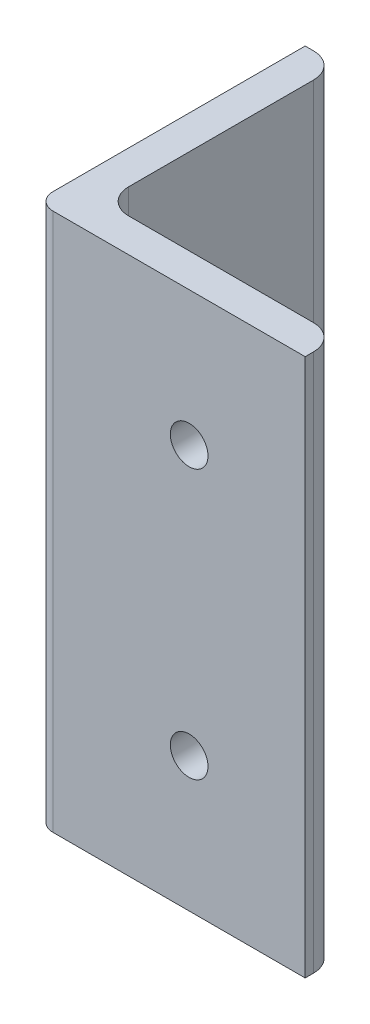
ISO-10303-21;
HEADER;
FILE_DESCRIPTION(('STEP AP214'),'2;1');
FILE_NAME('part.step','',(''),(''),'','','');
FILE_SCHEMA(('AUTOMOTIVE_DESIGN { 1 0 10303 214 1 1 1 1 }'));
ENDSEC;
DATA;
#1=APPLICATION_CONTEXT('core data for automotive mechanical design processes');
#2=APPLICATION_PROTOCOL_DEFINITION('international standard','automotive_design',2000,#1);
#3=PRODUCT_CONTEXT('',#1,'mechanical');
#4=PRODUCT('Part','Part','',(#3));
#5=PRODUCT_RELATED_PRODUCT_CATEGORY('part','',(#4));
#6=PRODUCT_DEFINITION_FORMATION('','',#4);
#7=PRODUCT_DEFINITION_CONTEXT('part definition',#1,'design');
#8=PRODUCT_DEFINITION('design','',#6,#7);
#9=PRODUCT_DEFINITION_SHAPE('','',#8);
#10=(LENGTH_UNIT() NAMED_UNIT(*) SI_UNIT(.MILLI.,.METRE.));
#11=(NAMED_UNIT(*) PLANE_ANGLE_UNIT() SI_UNIT($,.RADIAN.));
#12=(NAMED_UNIT(*) SI_UNIT($,.STERADIAN.) SOLID_ANGLE_UNIT());
#13=UNCERTAINTY_MEASURE_WITH_UNIT(LENGTH_MEASURE(1.E-05),#10,'distance_accuracy_value','');
#14=(GEOMETRIC_REPRESENTATION_CONTEXT(3) GLOBAL_UNCERTAINTY_ASSIGNED_CONTEXT((#13)) GLOBAL_UNIT_ASSIGNED_CONTEXT((#10,
#11,#12)) REPRESENTATION_CONTEXT('',''));
#15=CARTESIAN_POINT('',(0.,0.,0.));
#16=DIRECTION('',(0.,0.,1.));
#17=DIRECTION('',(1.,0.,0.));
#18=AXIS2_PLACEMENT_3D('',#15,#16,#17);
#19=CARTESIAN_POINT('',(25.4,50.8,0.));
#20=DIRECTION('',(0.,0.,-1.));
#21=DIRECTION('',(-1.,0.,0.));
#22=AXIS2_PLACEMENT_3D('',#19,#20,#21);
#23=PLANE('',#22);
#24=CARTESIAN_POINT('',(14.44625,38.1,0.));
#25=DIRECTION('',(0.,0.,-1.));
#26=DIRECTION('',(-1.,0.,0.));
#27=AXIS2_PLACEMENT_3D('',#24,#25,#26);
#28=CIRCLE('',#27,1.778);
#29=CARTESIAN_POINT('',(12.66825,38.1,0.));
#30=VERTEX_POINT('',#29);
#31=EDGE_CURVE('E240',#30,#30,#28,.T.);
#32=ORIENTED_EDGE('',*,*,#31,.T.);
#33=EDGE_LOOP('',(#32));
#34=FACE_BOUND('',#33,.T.);
#35=CARTESIAN_POINT('',(14.44625,12.7,0.));
#36=DIRECTION('',(0.,0.,-1.));
#37=DIRECTION('',(-1.,0.,0.));
#38=AXIS2_PLACEMENT_3D('',#35,#36,#37);
#39=CIRCLE('',#38,1.778);
#40=CARTESIAN_POINT('',(12.66825,12.7,0.));
#41=VERTEX_POINT('',#40);
#42=EDGE_CURVE('E245',#41,#41,#39,.T.);
#43=ORIENTED_EDGE('',*,*,#42,.T.);
#44=EDGE_LOOP('',(#43));
#45=FACE_BOUND('',#44,.T.);
#46=DIRECTION('',(1.,0.,0.));
#47=VECTOR('',#46,1.);
#48=CARTESIAN_POINT('',(25.4,50.8,0.));
#49=LINE('',#48,#47);
#50=CARTESIAN_POINT('',(1.5875,50.8,0.));
#51=VERTEX_POINT('',#50);
#52=CARTESIAN_POINT('',(25.4,50.8,0.));
#53=VERTEX_POINT('',#52);
#54=EDGE_CURVE('E113',#51,#53,#49,.T.);
#55=ORIENTED_EDGE('',*,*,#54,.F.);
#56=DIRECTION('',(0.,-1.,0.));
#57=VECTOR('',#56,1.);
#58=CARTESIAN_POINT('',(1.5875,50.8,0.));
#59=LINE('',#58,#57);
#60=CARTESIAN_POINT('',(1.5875,0.,0.));
#61=VERTEX_POINT('',#60);
#62=EDGE_CURVE('E169',#51,#61,#59,.T.);
#63=ORIENTED_EDGE('',*,*,#62,.T.);
#64=DIRECTION('',(1.,0.,0.));
#65=VECTOR('',#64,1.);
#66=CARTESIAN_POINT('',(25.4,0.,0.));
#67=LINE('',#66,#65);
#68=CARTESIAN_POINT('',(25.4,0.,0.));
#69=VERTEX_POINT('',#68);
#70=EDGE_CURVE('E134',#61,#69,#67,.T.);
#71=ORIENTED_EDGE('',*,*,#70,.T.);
#72=DIRECTION('',(0.,-1.,0.));
#73=VECTOR('',#72,1.);
#74=CARTESIAN_POINT('',(25.4,50.8,0.));
#75=LINE('',#74,#73);
#76=EDGE_CURVE('E129',#53,#69,#75,.T.);
#77=ORIENTED_EDGE('',*,*,#76,.F.);
#78=EDGE_LOOP('',(#55,#63,#71,#77));
#79=FACE_BOUND('',#78,.T.);
#80=ADVANCED_FACE('F36',(#34,#45,#79),#23,.F.);
#81=CARTESIAN_POINT('',(25.4,50.8,-3.175));
#82=DIRECTION('',(-1.,0.,0.));
#83=DIRECTION('',(0.,0.,1.));
#84=AXIS2_PLACEMENT_3D('',#81,#82,#83);
#85=PLANE('',#84);
#86=DIRECTION('',(0.,0.,-1.));
#87=VECTOR('',#86,1.);
#88=CARTESIAN_POINT('',(25.4,0.,-3.175));
#89=LINE('',#88,#87);
#90=CARTESIAN_POINT('',(25.4,0.,-0.79375));
#91=VERTEX_POINT('',#90);
#92=EDGE_CURVE('E173',#69,#91,#89,.T.);
#93=ORIENTED_EDGE('',*,*,#92,.T.);
#94=DIRECTION('',(0.,-1.,0.));
#95=VECTOR('',#94,1.);
#96=CARTESIAN_POINT('',(25.4,50.8,-0.79375));
#97=LINE('',#96,#95);
#98=CARTESIAN_POINT('',(25.4,50.8,-0.79375));
#99=VERTEX_POINT('',#98);
#100=EDGE_CURVE('E131',#91,#99,#97,.F.);
#101=ORIENTED_EDGE('',*,*,#100,.T.);
#102=DIRECTION('',(0.,0.,-1.));
#103=VECTOR('',#102,1.);
#104=CARTESIAN_POINT('',(25.4,50.8,-3.175));
#105=LINE('',#104,#103);
#106=EDGE_CURVE('E116',#53,#99,#105,.T.);
#107=ORIENTED_EDGE('',*,*,#106,.F.);
#108=ORIENTED_EDGE('',*,*,#76,.T.);
#109=EDGE_LOOP('',(#93,#101,#107,#108));
#110=FACE_BOUND('',#109,.T.);
#111=ADVANCED_FACE('F128',(#110),#85,.F.);
#112=CARTESIAN_POINT('',(3.175,50.8,-3.175));
#113=DIRECTION('',(0.,0.,1.));
#114=DIRECTION('',(1.,0.,0.));
#115=AXIS2_PLACEMENT_3D('',#112,#113,#114);
#116=PLANE('',#115);
#117=CARTESIAN_POINT('',(14.44625,38.1,-3.175));
#118=DIRECTION('',(0.,0.,-1.));
#119=DIRECTION('',(-1.,0.,0.));
#120=AXIS2_PLACEMENT_3D('',#117,#118,#119);
#121=CIRCLE('',#120,1.778);
#122=CARTESIAN_POINT('',(12.66825,38.1,-3.175));
#123=VERTEX_POINT('',#122);
#124=EDGE_CURVE('E248',#123,#123,#121,.T.);
#125=ORIENTED_EDGE('',*,*,#124,.F.);
#126=EDGE_LOOP('',(#125));
#127=FACE_BOUND('',#126,.T.);
#128=CARTESIAN_POINT('',(14.44625,12.7,-3.175));
#129=DIRECTION('',(0.,0.,-1.));
#130=DIRECTION('',(-1.,0.,0.));
#131=AXIS2_PLACEMENT_3D('',#128,#129,#130);
#132=CIRCLE('',#131,1.778);
#133=CARTESIAN_POINT('',(12.66825,12.7,-3.175));
#134=VERTEX_POINT('',#133);
#135=EDGE_CURVE('E242',#134,#134,#132,.T.);
#136=ORIENTED_EDGE('',*,*,#135,.F.);
#137=EDGE_LOOP('',(#136));
#138=FACE_BOUND('',#137,.T.);
#139=DIRECTION('',(-1.,0.,0.));
#140=VECTOR('',#139,1.);
#141=CARTESIAN_POINT('',(3.175,0.,-3.175));
#142=LINE('',#141,#140);
#143=CARTESIAN_POINT('',(23.01875,0.,-3.175));
#144=VERTEX_POINT('',#143);
#145=CARTESIAN_POINT('',(5.55625,0.,-3.175));
#146=VERTEX_POINT('',#145);
#147=EDGE_CURVE('E176',#144,#146,#142,.T.);
#148=ORIENTED_EDGE('',*,*,#147,.T.);
#149=DIRECTION('',(0.,-1.,0.));
#150=VECTOR('',#149,1.);
#151=CARTESIAN_POINT('',(5.55625,50.8,-3.175));
#152=LINE('',#151,#150);
#153=CARTESIAN_POINT('',(5.55625,50.8,-3.175));
#154=VERTEX_POINT('',#153);
#155=EDGE_CURVE('E151',#146,#154,#152,.F.);
#156=ORIENTED_EDGE('',*,*,#155,.T.);
#157=DIRECTION('',(-1.,0.,0.));
#158=VECTOR('',#157,1.);
#159=CARTESIAN_POINT('',(3.175,50.8,-3.175));
#160=LINE('',#159,#158);
#161=CARTESIAN_POINT('',(23.01875,50.8,-3.175));
#162=VERTEX_POINT('',#161);
#163=EDGE_CURVE('E132',#162,#154,#160,.T.);
#164=ORIENTED_EDGE('',*,*,#163,.F.);
#165=DIRECTION('',(0.,-1.,0.));
#166=VECTOR('',#165,1.);
#167=CARTESIAN_POINT('',(23.01875,50.8,-3.175));
#168=LINE('',#167,#166);
#169=EDGE_CURVE('E148',#162,#144,#168,.T.);
#170=ORIENTED_EDGE('',*,*,#169,.T.);
#171=EDGE_LOOP('',(#148,#156,#164,#170));
#172=FACE_BOUND('',#171,.T.);
#173=ADVANCED_FACE('F211',(#127,#138,#172),#116,.F.);
#174=CARTESIAN_POINT('',(3.175,50.8,-25.4));
#175=DIRECTION('',(-1.,0.,0.));
#176=DIRECTION('',(0.,0.,1.));
#177=AXIS2_PLACEMENT_3D('',#174,#175,#176);
#178=PLANE('',#177);
#179=CARTESIAN_POINT('',(3.175,25.4,-13.97));
#180=DIRECTION('',(1.,0.,0.));
#181=DIRECTION('',(0.,0.,-1.));
#182=AXIS2_PLACEMENT_3D('',#179,#180,#181);
#183=CIRCLE('',#182,6.35);
#184=CARTESIAN_POINT('',(3.175,25.4,-20.32));
#185=VERTEX_POINT('',#184);
#186=EDGE_CURVE('E179',#185,#185,#183,.T.);
#187=ORIENTED_EDGE('',*,*,#186,.F.);
#188=EDGE_LOOP('',(#187));
#189=FACE_BOUND('',#188,.T.);
#190=DIRECTION('',(0.,0.,-1.));
#191=VECTOR('',#190,1.);
#192=CARTESIAN_POINT('',(3.175,50.8,-25.4));
#193=LINE('',#192,#191);
#194=CARTESIAN_POINT('',(3.175,50.8,-5.55625));
#195=VERTEX_POINT('',#194);
#196=CARTESIAN_POINT('',(3.175,50.8,-23.01875));
#197=VERTEX_POINT('',#196);
#198=EDGE_CURVE('E232',#195,#197,#193,.T.);
#199=ORIENTED_EDGE('',*,*,#198,.F.);
#200=DIRECTION('',(0.,-1.,0.));
#201=VECTOR('',#200,1.);
#202=CARTESIAN_POINT('',(3.175,0.,-5.55625));
#203=LINE('',#202,#201);
#204=CARTESIAN_POINT('',(3.175,0.,-5.55625));
#205=VERTEX_POINT('',#204);
#206=EDGE_CURVE('E139',#195,#205,#203,.T.);
#207=ORIENTED_EDGE('',*,*,#206,.T.);
#208=DIRECTION('',(0.,0.,-1.));
#209=VECTOR('',#208,1.);
#210=CARTESIAN_POINT('',(3.175,0.,-25.4));
#211=LINE('',#210,#209);
#212=CARTESIAN_POINT('',(3.175,0.,-23.01875));
#213=VERTEX_POINT('',#212);
#214=EDGE_CURVE('E186',#205,#213,#211,.T.);
#215=ORIENTED_EDGE('',*,*,#214,.T.);
#216=DIRECTION('',(0.,-1.,0.));
#217=VECTOR('',#216,1.);
#218=CARTESIAN_POINT('',(3.175,50.8,-23.01875));
#219=LINE('',#218,#217);
#220=EDGE_CURVE('E136',#213,#197,#219,.F.);
#221=ORIENTED_EDGE('',*,*,#220,.T.);
#222=EDGE_LOOP('',(#199,#207,#215,#221));
#223=FACE_BOUND('',#222,.T.);
#224=ADVANCED_FACE('F261',(#189,#223),#178,.F.);
#225=CARTESIAN_POINT('',(0.,50.8,-25.4));
#226=DIRECTION('',(0.,0.,1.));
#227=DIRECTION('',(1.,0.,0.));
#228=AXIS2_PLACEMENT_3D('',#225,#226,#227);
#229=PLANE('',#228);
#230=DIRECTION('',(-1.,0.,0.));
#231=VECTOR('',#230,1.);
#232=CARTESIAN_POINT('',(0.,50.8,-25.4));
#233=LINE('',#232,#231);
#234=CARTESIAN_POINT('',(0.79375,50.8,-25.4));
#235=VERTEX_POINT('',#234);
#236=CARTESIAN_POINT('',(0.,50.8,-25.4));
#237=VERTEX_POINT('',#236);
#238=EDGE_CURVE('E230',#235,#237,#233,.T.);
#239=ORIENTED_EDGE('',*,*,#238,.F.);
#240=DIRECTION('',(0.,-1.,0.));
#241=VECTOR('',#240,1.);
#242=CARTESIAN_POINT('',(0.79375,50.8,-25.4));
#243=LINE('',#242,#241);
#244=CARTESIAN_POINT('',(0.79375,0.,-25.4));
#245=VERTEX_POINT('',#244);
#246=EDGE_CURVE('E153',#235,#245,#243,.T.);
#247=ORIENTED_EDGE('',*,*,#246,.T.);
#248=DIRECTION('',(-1.,0.,0.));
#249=VECTOR('',#248,1.);
#250=CARTESIAN_POINT('',(0.,0.,-25.4));
#251=LINE('',#250,#249);
#252=CARTESIAN_POINT('',(0.,0.,-25.4));
#253=VERTEX_POINT('',#252);
#254=EDGE_CURVE('E189',#245,#253,#251,.T.);
#255=ORIENTED_EDGE('',*,*,#254,.T.);
#256=DIRECTION('',(0.,-1.,0.));
#257=VECTOR('',#256,1.);
#258=CARTESIAN_POINT('',(0.,50.8,-25.4));
#259=LINE('',#258,#257);
#260=EDGE_CURVE('E137',#237,#253,#259,.T.);
#261=ORIENTED_EDGE('',*,*,#260,.F.);
#262=EDGE_LOOP('',(#239,#247,#255,#261));
#263=FACE_BOUND('',#262,.T.);
#264=ADVANCED_FACE('F234',(#263),#229,.F.);
#265=CARTESIAN_POINT('',(0.,50.8,0.));
#266=DIRECTION('',(1.,0.,0.));
#267=DIRECTION('',(0.,0.,-1.));
#268=AXIS2_PLACEMENT_3D('',#265,#266,#267);
#269=PLANE('',#268);
#270=CARTESIAN_POINT('',(0.,25.4,-13.97));
#271=DIRECTION('',(1.,0.,0.));
#272=DIRECTION('',(0.,0.,-1.));
#273=AXIS2_PLACEMENT_3D('',#270,#271,#272);
#274=CIRCLE('',#273,6.35);
#275=CARTESIAN_POINT('',(0.,25.4,-20.32));
#276=VERTEX_POINT('',#275);
#277=EDGE_CURVE('E174',#276,#276,#274,.T.);
#278=ORIENTED_EDGE('',*,*,#277,.T.);
#279=EDGE_LOOP('',(#278));
#280=FACE_BOUND('',#279,.T.);
#281=DIRECTION('',(0.,0.,1.));
#282=VECTOR('',#281,1.);
#283=CARTESIAN_POINT('',(0.,0.,0.));
#284=LINE('',#283,#282);
#285=CARTESIAN_POINT('',(0.,0.,-1.5875));
#286=VERTEX_POINT('',#285);
#287=EDGE_CURVE('E123',#253,#286,#284,.T.);
#288=ORIENTED_EDGE('',*,*,#287,.T.);
#289=DIRECTION('',(0.,-1.,0.));
#290=VECTOR('',#289,1.);
#291=CARTESIAN_POINT('',(0.,50.8,-1.5875));
#292=LINE('',#291,#290);
#293=CARTESIAN_POINT('',(0.,50.8,-1.5875));
#294=VERTEX_POINT('',#293);
#295=EDGE_CURVE('E44',#286,#294,#292,.F.);
#296=ORIENTED_EDGE('',*,*,#295,.T.);
#297=DIRECTION('',(0.,0.,1.));
#298=VECTOR('',#297,1.);
#299=CARTESIAN_POINT('',(0.,50.8,0.));
#300=LINE('',#299,#298);
#301=EDGE_CURVE('E142',#237,#294,#300,.T.);
#302=ORIENTED_EDGE('',*,*,#301,.F.);
#303=ORIENTED_EDGE('',*,*,#260,.T.);
#304=EDGE_LOOP('',(#288,#296,#302,#303));
#305=FACE_BOUND('',#304,.T.);
#306=ADVANCED_FACE('F190',(#280,#305),#269,.F.);
#307=CARTESIAN_POINT('',(0.,50.8,0.));
#308=DIRECTION('',(0.,-1.,0.));
#309=DIRECTION('',(0.,0.,-1.));
#310=AXIS2_PLACEMENT_3D('',#307,#308,#309);
#311=PLANE('',#310);
#312=ORIENTED_EDGE('',*,*,#301,.T.);
#313=CARTESIAN_POINT('',(1.5875,50.8,-1.5875));
#314=DIRECTION('',(0.,-1.,0.));
#315=DIRECTION('',(0.,0.,-1.));
#316=AXIS2_PLACEMENT_3D('',#313,#314,#315);
#317=CIRCLE('',#316,1.5875);
#318=EDGE_CURVE('E11',#294,#51,#317,.F.);
#319=ORIENTED_EDGE('',*,*,#318,.T.);
#320=ORIENTED_EDGE('',*,*,#54,.T.);
#321=ORIENTED_EDGE('',*,*,#106,.T.);
#322=CARTESIAN_POINT('',(23.01875,50.8,-0.79375));
#323=DIRECTION('',(0.,-1.,0.));
#324=DIRECTION('',(0.,0.,-1.));
#325=AXIS2_PLACEMENT_3D('',#322,#323,#324);
#326=CIRCLE('',#325,2.38125);
#327=EDGE_CURVE('E160',#99,#162,#326,.F.);
#328=ORIENTED_EDGE('',*,*,#327,.T.);
#329=ORIENTED_EDGE('',*,*,#163,.T.);
#330=CARTESIAN_POINT('',(5.55625,50.8,-5.55625));
#331=DIRECTION('',(0.,-1.,0.));
#332=DIRECTION('',(0.,0.,-1.));
#333=AXIS2_PLACEMENT_3D('',#330,#331,#332);
#334=CIRCLE('',#333,2.38125);
#335=EDGE_CURVE('E167',#154,#195,#334,.T.);
#336=ORIENTED_EDGE('',*,*,#335,.T.);
#337=ORIENTED_EDGE('',*,*,#198,.T.);
#338=CARTESIAN_POINT('',(0.79375,50.8,-23.01875));
#339=DIRECTION('',(0.,-1.,0.));
#340=DIRECTION('',(0.,0.,-1.));
#341=AXIS2_PLACEMENT_3D('',#338,#339,#340);
#342=CIRCLE('',#341,2.38125);
#343=EDGE_CURVE('E162',#197,#235,#342,.F.);
#344=ORIENTED_EDGE('',*,*,#343,.T.);
#345=ORIENTED_EDGE('',*,*,#238,.T.);
#346=EDGE_LOOP('',(#312,#319,#320,#321,#328,#329,#336,#337,#344,#345));
#347=FACE_BOUND('',#346,.T.);
#348=ADVANCED_FACE('F115',(#347),#311,.F.);
#349=CARTESIAN_POINT('',(0.,0.,0.));
#350=DIRECTION('',(0.,-1.,0.));
#351=DIRECTION('',(0.,0.,-1.));
#352=AXIS2_PLACEMENT_3D('',#349,#350,#351);
#353=PLANE('',#352);
#354=ORIENTED_EDGE('',*,*,#70,.F.);
#355=CARTESIAN_POINT('',(1.5875,0.,-1.5875));
#356=DIRECTION('',(0.,-1.,0.));
#357=DIRECTION('',(0.,0.,-1.));
#358=AXIS2_PLACEMENT_3D('',#355,#356,#357);
#359=CIRCLE('',#358,1.5875);
#360=EDGE_CURVE('E58',#61,#286,#359,.T.);
#361=ORIENTED_EDGE('',*,*,#360,.T.);
#362=ORIENTED_EDGE('',*,*,#287,.F.);
#363=ORIENTED_EDGE('',*,*,#254,.F.);
#364=CARTESIAN_POINT('',(0.79375,0.,-23.01875));
#365=DIRECTION('',(0.,-1.,0.));
#366=DIRECTION('',(0.,0.,-1.));
#367=AXIS2_PLACEMENT_3D('',#364,#365,#366);
#368=CIRCLE('',#367,2.38125);
#369=EDGE_CURVE('E158',#245,#213,#368,.T.);
#370=ORIENTED_EDGE('',*,*,#369,.T.);
#371=ORIENTED_EDGE('',*,*,#214,.F.);
#372=CARTESIAN_POINT('',(5.55625,0.,-5.55625));
#373=DIRECTION('',(0.,-1.,0.));
#374=DIRECTION('',(0.,0.,-1.));
#375=AXIS2_PLACEMENT_3D('',#372,#373,#374);
#376=CIRCLE('',#375,2.38125);
#377=EDGE_CURVE('E165',#205,#146,#376,.F.);
#378=ORIENTED_EDGE('',*,*,#377,.T.);
#379=ORIENTED_EDGE('',*,*,#147,.F.);
#380=CARTESIAN_POINT('',(23.01875,0.,-0.79375));
#381=DIRECTION('',(0.,-1.,0.));
#382=DIRECTION('',(0.,0.,-1.));
#383=AXIS2_PLACEMENT_3D('',#380,#381,#382);
#384=CIRCLE('',#383,2.38125);
#385=EDGE_CURVE('E156',#144,#91,#384,.T.);
#386=ORIENTED_EDGE('',*,*,#385,.T.);
#387=ORIENTED_EDGE('',*,*,#92,.F.);
#388=EDGE_LOOP('',(#354,#361,#362,#363,#370,#371,#378,#379,#386,#387));
#389=FACE_BOUND('',#388,.T.);
#390=ADVANCED_FACE('F172',(#389),#353,.T.);
#391=CARTESIAN_POINT('',(5.55625,50.8,-5.55625));
#392=DIRECTION('',(0.,1.,0.));
#393=DIRECTION('',(0.,0.,1.));
#394=AXIS2_PLACEMENT_3D('',#391,#392,#393);
#395=CYLINDRICAL_SURFACE('',#394,2.38125);
#396=ORIENTED_EDGE('',*,*,#335,.F.);
#397=ORIENTED_EDGE('',*,*,#155,.F.);
#398=ORIENTED_EDGE('',*,*,#377,.F.);
#399=ORIENTED_EDGE('',*,*,#206,.F.);
#400=EDGE_LOOP('',(#396,#397,#398,#399));
#401=FACE_BOUND('',#400,.T.);
#402=ADVANCED_FACE('F217',(#401),#395,.F.);
#403=CARTESIAN_POINT('',(0.79375,50.8,-23.01875));
#404=DIRECTION('',(0.,-1.,0.));
#405=DIRECTION('',(0.,0.,-1.));
#406=AXIS2_PLACEMENT_3D('',#403,#404,#405);
#407=CYLINDRICAL_SURFACE('',#406,2.38125);
#408=ORIENTED_EDGE('',*,*,#343,.F.);
#409=ORIENTED_EDGE('',*,*,#220,.F.);
#410=ORIENTED_EDGE('',*,*,#369,.F.);
#411=ORIENTED_EDGE('',*,*,#246,.F.);
#412=EDGE_LOOP('',(#408,#409,#410,#411));
#413=FACE_BOUND('',#412,.T.);
#414=ADVANCED_FACE('F203',(#413),#407,.T.);
#415=CARTESIAN_POINT('',(23.01875,50.8,-0.79375));
#416=DIRECTION('',(0.,-1.,0.));
#417=DIRECTION('',(0.,0.,-1.));
#418=AXIS2_PLACEMENT_3D('',#415,#416,#417);
#419=CYLINDRICAL_SURFACE('',#418,2.38125);
#420=ORIENTED_EDGE('',*,*,#327,.F.);
#421=ORIENTED_EDGE('',*,*,#100,.F.);
#422=ORIENTED_EDGE('',*,*,#385,.F.);
#423=ORIENTED_EDGE('',*,*,#169,.F.);
#424=EDGE_LOOP('',(#420,#421,#422,#423));
#425=FACE_BOUND('',#424,.T.);
#426=ADVANCED_FACE('F195',(#425),#419,.T.);
#427=CARTESIAN_POINT('',(1.5875,50.8,-1.5875));
#428=DIRECTION('',(0.,-1.,0.));
#429=DIRECTION('',(0.,0.,-1.));
#430=AXIS2_PLACEMENT_3D('',#427,#428,#429);
#431=CYLINDRICAL_SURFACE('',#430,1.5875);
#432=ORIENTED_EDGE('',*,*,#318,.F.);
#433=ORIENTED_EDGE('',*,*,#295,.F.);
#434=ORIENTED_EDGE('',*,*,#360,.F.);
#435=ORIENTED_EDGE('',*,*,#62,.F.);
#436=EDGE_LOOP('',(#432,#433,#434,#435));
#437=FACE_BOUND('',#436,.T.);
#438=ADVANCED_FACE('F38',(#437),#431,.T.);
#439=CARTESIAN_POINT('',(0.,25.4,-13.97));
#440=DIRECTION('',(1.,0.,0.));
#441=DIRECTION('',(0.,0.,-1.));
#442=AXIS2_PLACEMENT_3D('',#439,#440,#441);
#443=CYLINDRICAL_SURFACE('',#442,6.35);
#444=ORIENTED_EDGE('',*,*,#277,.F.);
#445=EDGE_LOOP('',(#444));
#446=FACE_BOUND('',#445,.T.);
#447=ORIENTED_EDGE('',*,*,#186,.T.);
#448=EDGE_LOOP('',(#447));
#449=FACE_BOUND('',#448,.T.);
#450=ADVANCED_FACE('F194',(#446,#449),#443,.F.);
#451=CARTESIAN_POINT('',(14.44625,12.7,0.));
#452=DIRECTION('',(0.,0.,-1.));
#453=DIRECTION('',(-1.,0.,0.));
#454=AXIS2_PLACEMENT_3D('',#451,#452,#453);
#455=CYLINDRICAL_SURFACE('',#454,1.778);
#456=ORIENTED_EDGE('',*,*,#42,.F.);
#457=EDGE_LOOP('',(#456));
#458=FACE_BOUND('',#457,.T.);
#459=ORIENTED_EDGE('',*,*,#135,.T.);
#460=EDGE_LOOP('',(#459));
#461=FACE_BOUND('',#460,.T.);
#462=ADVANCED_FACE('F200',(#458,#461),#455,.F.);
#463=CARTESIAN_POINT('',(14.44625,38.1,0.));
#464=DIRECTION('',(0.,0.,-1.));
#465=DIRECTION('',(-1.,0.,0.));
#466=AXIS2_PLACEMENT_3D('',#463,#464,#465);
#467=CYLINDRICAL_SURFACE('',#466,1.778);
#468=ORIENTED_EDGE('',*,*,#31,.F.);
#469=EDGE_LOOP('',(#468));
#470=FACE_BOUND('',#469,.T.);
#471=ORIENTED_EDGE('',*,*,#124,.T.);
#472=EDGE_LOOP('',(#471));
#473=FACE_BOUND('',#472,.T.);
#474=ADVANCED_FACE('F253',(#470,#473),#467,.F.);
#475=CLOSED_SHELL('',(#80,#111,#173,#224,#264,#306,#348,#390,#402,#414,#426,#438,#450,#462,#474));
#476=MANIFOLD_SOLID_BREP('B2',#475);
#477=ADVANCED_BREP_SHAPE_REPRESENTATION('',(#18,#476),#14);
#478=SHAPE_DEFINITION_REPRESENTATION(#9,#477);
ENDSEC;
END-ISO-10303-21;
